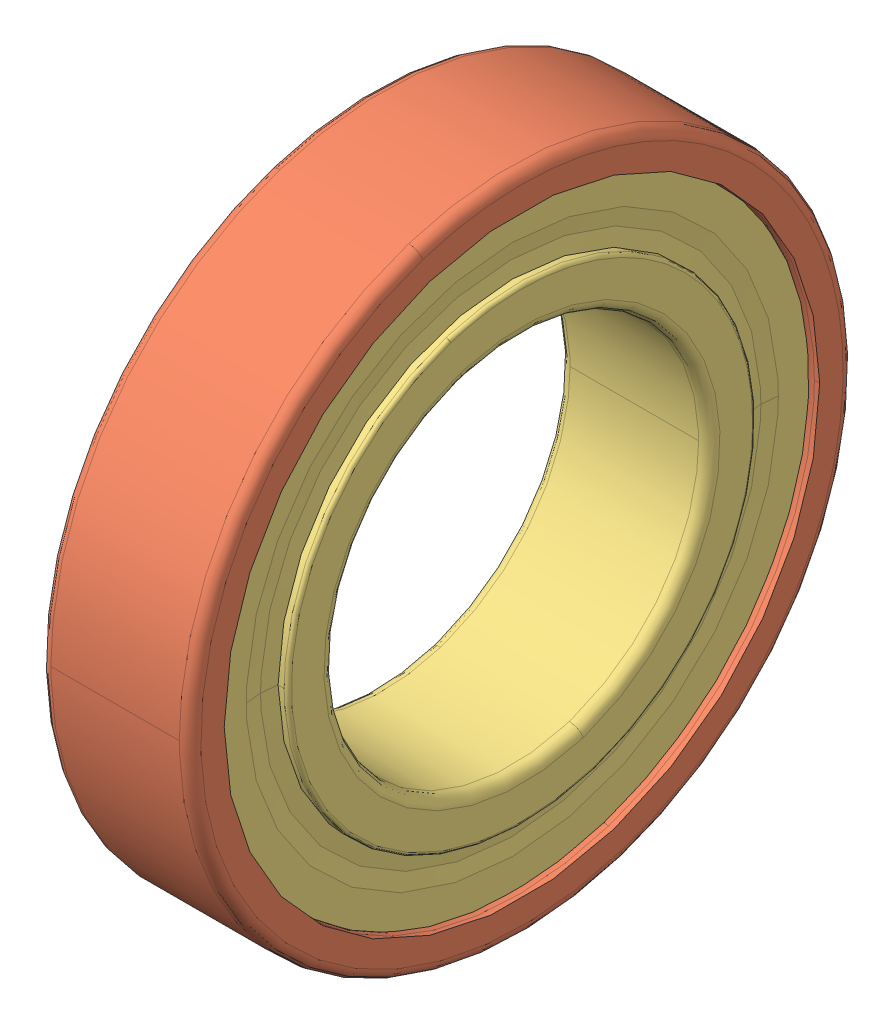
SolidWorks assembly SKF_6007_2RS1.sldasm, configuration Default (file format 12000). Lengths in mm.
Overall size (14 62 62).
13 component instances, 3 part files, 0 mates.
Components (placement in the parent):
- SKF_6007_2RS1_15-1: SKF_6007_2RS1_15.sldprt [Default] x (1 0 0) z (0 -0.540641 0.841254) size (7.94 7.94 7.94)
- SKF_6007_2RS1_15-2: SKF_6007_2RS1_15.sldprt [Default] x (1 0 0) z (0 -0.909632 0.415415) size (7.94 7.94 7.94)
- SKF_6007_2RS1_15-3: SKF_6007_2RS1_15.sldprt [Default] x (1 0 0) z (0 -0.989821 -0.142315) size (7.94 7.94 7.94)
- SKF_6007_2RS1_15-4: SKF_6007_2RS1_15.sldprt [Default] x (1 0 0) z (0 -0.75575 -0.654861) size (7.94 7.94 7.94)
- SKF_6007_2RS1_15-5: SKF_6007_2RS1_15.sldprt [Default] x (1 0 0) z (0 -0.281733 -0.959493) size (7.94 7.94 7.94)
- SKF_6007_2RS1_15-6: SKF_6007_2RS1_15.sldprt [Default] x (1 0 0) z (0 0.281733 -0.959493) size (7.94 7.94 7.94)
- SKF_6007_2RS1_15-7: SKF_6007_2RS1_15.sldprt [Default] x (1 0 0) z (0 0.75575 -0.654861) size (7.94 7.94 7.94)
- SKF_6007_2RS1_15-8: SKF_6007_2RS1_15.sldprt [Default] x (1 0 0) z (0 0.989821 -0.142315) size (7.94 7.94 7.94)
- SKF_6007_2RS1_15-9: SKF_6007_2RS1_15.sldprt [Default] x (1 0 0) z (0 0.909632 0.415415) size (7.94 7.94 7.94)
- SKF_6007_2RS1_15-10: SKF_6007_2RS1_15.sldprt [Default] x (1 0 0) z (0 0.540641 0.841254) size (7.94 7.94 7.94)
- SKF_6007_2RS1_15-11: SKF_6007_2RS1_15.sldprt [Default] at origin size (7.94 7.94 7.94)
- SKF_6007_2RS1_27-1: SKF_6007_2RS1_27.sldprt [Default] at origin size (14 62 62)
- SKF_6007_2RS1_29-1: SKF_6007_2RS1_29.sldprt [Default] at origin size (14 55.61 55.61)
